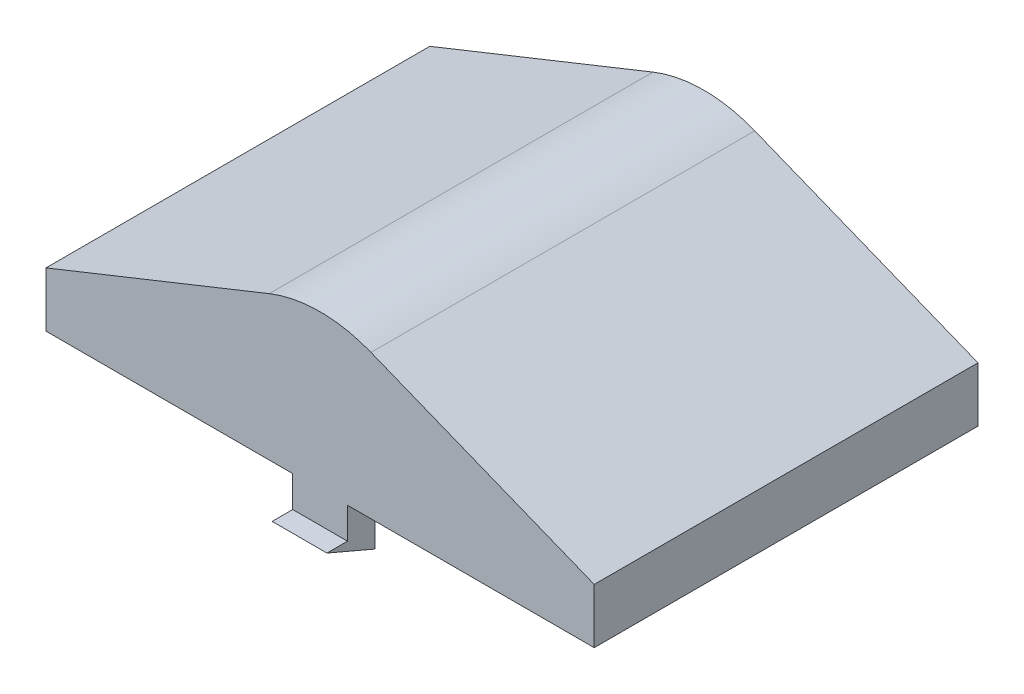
from build123d import *

# Parameters (mm, degrees)
EXTRUDE1_DEPTH = 7
FILLET1_R      = 5
SHELL1_T       = -1
EXTRUDE2_DEPTH = 1


with BuildPart() as part:
    # Sketch1 → Extrude1 (new, symmetric)
    with BuildSketch(Plane.XY):
        Polygon((-10, 0), (10, 0), (10, 2), (0, 6), (-10, 2), align=None)
    extrude(amount=EXTRUDE1_DEPTH, both=True)

    # Fillet1
    fillet1_edges = [part.edges().sort_by_distance(p)[0] for p in [
        (0, 6, 0),
    ]]
    fillet(fillet1_edges, radius=FILLET1_R)

    # Shell1
    shell1_openings = [part.faces().sort_by_distance(p)[0] for p in [
        (0, 0, 0),
    ]]
    offset(amount=SHELL1_T, openings=shell1_openings, kind=Kind.INTERSECTION)

    # Sketch2 → Extrude2 (add, symmetric)
    with BuildSketch(Plane(origin=(0, 0, 0), x_dir=(0, 0, -1), z_dir=(1, 0, 0))):
        Polygon((-6, 0), (-7, 0), (-7, -1.135164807), (-7.75, -1.135164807), (-6, -1.885164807), align=None)
    extrude2 = extrude(amount=EXTRUDE2_DEPTH, both=True)

    # Mirror1: Extrude2 across plane
    add(extrude2.mirror(Plane.XY))


solid = part.part
